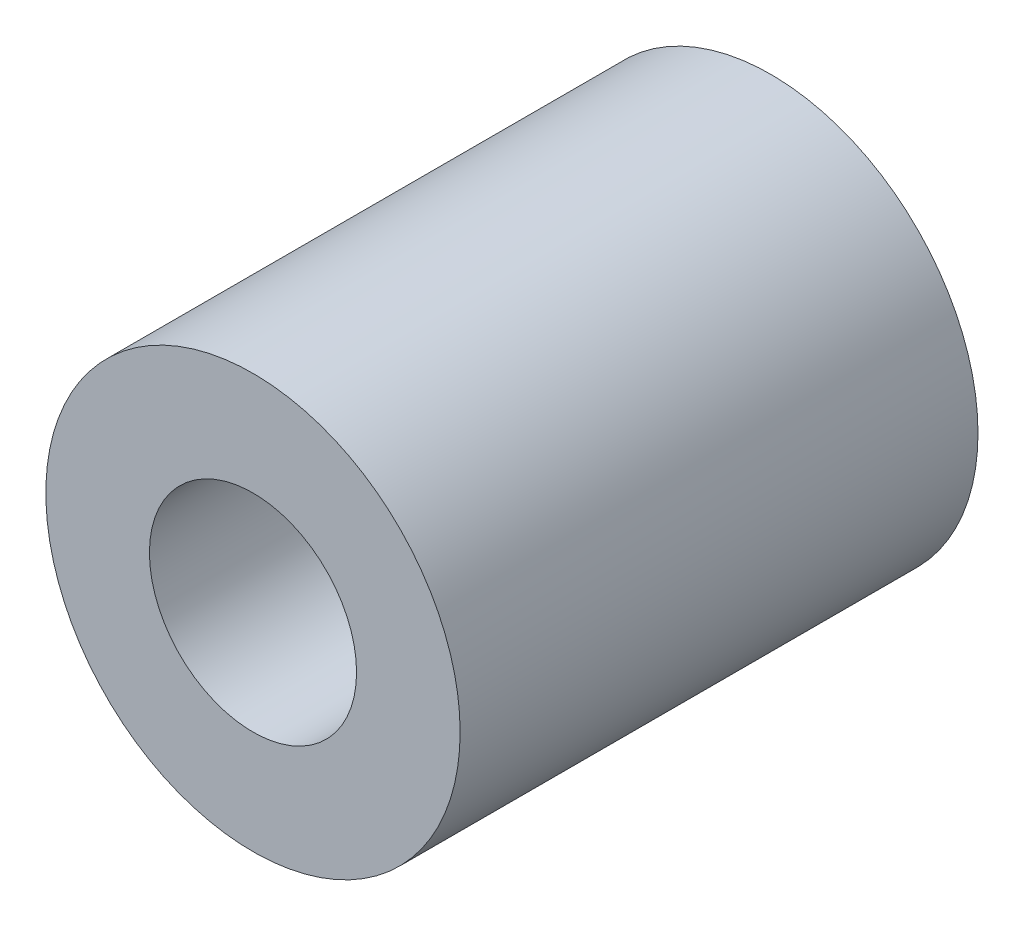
ISO-10303-21;
HEADER;
FILE_DESCRIPTION(('STEP AP214'),'2;1');
FILE_NAME('part.step','',(''),(''),'','','');
FILE_SCHEMA(('AUTOMOTIVE_DESIGN { 1 0 10303 214 1 1 1 1 }'));
ENDSEC;
DATA;
#1=APPLICATION_CONTEXT('core data for automotive mechanical design processes');
#2=APPLICATION_PROTOCOL_DEFINITION('international standard','automotive_design',2000,#1);
#3=PRODUCT_CONTEXT('',#1,'mechanical');
#4=PRODUCT('Part','Part','',(#3));
#5=PRODUCT_RELATED_PRODUCT_CATEGORY('part','',(#4));
#6=PRODUCT_DEFINITION_FORMATION('','',#4);
#7=PRODUCT_DEFINITION_CONTEXT('part definition',#1,'design');
#8=PRODUCT_DEFINITION('design','',#6,#7);
#9=PRODUCT_DEFINITION_SHAPE('','',#8);
#10=(LENGTH_UNIT() NAMED_UNIT(*) SI_UNIT(.MILLI.,.METRE.));
#11=(NAMED_UNIT(*) PLANE_ANGLE_UNIT() SI_UNIT($,.RADIAN.));
#12=(NAMED_UNIT(*) SI_UNIT($,.STERADIAN.) SOLID_ANGLE_UNIT());
#13=UNCERTAINTY_MEASURE_WITH_UNIT(LENGTH_MEASURE(1.E-05),#10,'distance_accuracy_value','');
#14=(GEOMETRIC_REPRESENTATION_CONTEXT(3) GLOBAL_UNCERTAINTY_ASSIGNED_CONTEXT((#13)) GLOBAL_UNIT_ASSIGNED_CONTEXT((#10,
#11,#12)) REPRESENTATION_CONTEXT('',''));
#15=CARTESIAN_POINT('',(0.,0.,0.));
#16=DIRECTION('',(0.,0.,1.));
#17=DIRECTION('',(1.,0.,0.));
#18=AXIS2_PLACEMENT_3D('',#15,#16,#17);
#19=CARTESIAN_POINT('',(0.,0.,40.));
#20=DIRECTION('',(0.,0.,1.));
#21=DIRECTION('',(1.,0.,0.));
#22=AXIS2_PLACEMENT_3D('',#19,#20,#21);
#23=CYLINDRICAL_SURFACE('',#22,6.);
#24=CARTESIAN_POINT('',(0.,0.,0.));
#25=DIRECTION('',(0.,0.,1.));
#26=DIRECTION('',(1.,0.,0.));
#27=AXIS2_PLACEMENT_3D('',#24,#25,#26);
#28=CIRCLE('',#27,6.);
#29=CARTESIAN_POINT('',(6.,0.,0.));
#30=VERTEX_POINT('',#29);
#31=EDGE_CURVE('E8',#30,#30,#28,.T.);
#32=ORIENTED_EDGE('',*,*,#31,.F.);
#33=EDGE_LOOP('',(#32));
#34=FACE_BOUND('',#33,.T.);
#35=CARTESIAN_POINT('',(0.,0.,12.));
#36=DIRECTION('',(0.,0.,1.));
#37=DIRECTION('',(1.,0.,0.));
#38=AXIS2_PLACEMENT_3D('',#35,#36,#37);
#39=CIRCLE('',#38,6.);
#40=CARTESIAN_POINT('',(6.,0.,12.));
#41=VERTEX_POINT('',#40);
#42=EDGE_CURVE('E34',#41,#41,#39,.T.);
#43=ORIENTED_EDGE('',*,*,#42,.T.);
#44=EDGE_LOOP('',(#43));
#45=FACE_BOUND('',#44,.T.);
#46=ADVANCED_FACE('F12',(#34,#45),#23,.F.);
#47=CARTESIAN_POINT('',(6.,0.,0.));
#48=DIRECTION('',(0.,0.,1.));
#49=DIRECTION('',(1.,0.,0.));
#50=AXIS2_PLACEMENT_3D('',#47,#48,#49);
#51=PLANE('',#50);
#52=CARTESIAN_POINT('',(0.,0.,0.));
#53=DIRECTION('',(0.,0.,1.));
#54=DIRECTION('',(1.,0.,0.));
#55=AXIS2_PLACEMENT_3D('',#52,#53,#54);
#56=CIRCLE('',#55,20.);
#57=CARTESIAN_POINT('',(20.,0.,0.));
#58=VERTEX_POINT('',#57);
#59=EDGE_CURVE('E18',#58,#58,#56,.T.);
#60=ORIENTED_EDGE('',*,*,#59,.F.);
#61=EDGE_LOOP('',(#60));
#62=FACE_BOUND('',#61,.T.);
#63=ORIENTED_EDGE('',*,*,#31,.T.);
#64=EDGE_LOOP('',(#63));
#65=FACE_BOUND('',#64,.T.);
#66=ADVANCED_FACE('F59',(#62,#65),#51,.F.);
#67=CARTESIAN_POINT('',(0.,0.,40.));
#68=DIRECTION('',(0.,0.,1.));
#69=DIRECTION('',(1.,0.,0.));
#70=AXIS2_PLACEMENT_3D('',#67,#68,#69);
#71=CYLINDRICAL_SURFACE('',#70,20.);
#72=CARTESIAN_POINT('',(0.,0.,50.));
#73=DIRECTION('',(0.,0.,1.));
#74=DIRECTION('',(1.,0.,0.));
#75=AXIS2_PLACEMENT_3D('',#72,#73,#74);
#76=CIRCLE('',#75,20.);
#77=CARTESIAN_POINT('',(20.,0.,50.));
#78=VERTEX_POINT('',#77);
#79=EDGE_CURVE('E22',#78,#78,#76,.T.);
#80=ORIENTED_EDGE('',*,*,#79,.F.);
#81=EDGE_LOOP('',(#80));
#82=FACE_BOUND('',#81,.T.);
#83=ORIENTED_EDGE('',*,*,#59,.T.);
#84=EDGE_LOOP('',(#83));
#85=FACE_BOUND('',#84,.T.);
#86=ADVANCED_FACE('F54',(#82,#85),#71,.T.);
#87=CARTESIAN_POINT('',(20.,0.,50.));
#88=DIRECTION('',(0.,0.,-1.));
#89=DIRECTION('',(-1.,0.,0.));
#90=AXIS2_PLACEMENT_3D('',#87,#88,#89);
#91=PLANE('',#90);
#92=CARTESIAN_POINT('',(0.,0.,50.));
#93=DIRECTION('',(0.,0.,1.));
#94=DIRECTION('',(1.,0.,0.));
#95=AXIS2_PLACEMENT_3D('',#92,#93,#94);
#96=CIRCLE('',#95,10.);
#97=CARTESIAN_POINT('',(10.,0.,50.));
#98=VERTEX_POINT('',#97);
#99=EDGE_CURVE('E26',#98,#98,#96,.T.);
#100=ORIENTED_EDGE('',*,*,#99,.F.);
#101=EDGE_LOOP('',(#100));
#102=FACE_BOUND('',#101,.T.);
#103=ORIENTED_EDGE('',*,*,#79,.T.);
#104=EDGE_LOOP('',(#103));
#105=FACE_BOUND('',#104,.T.);
#106=ADVANCED_FACE('F48',(#102,#105),#91,.F.);
#107=CARTESIAN_POINT('',(0.,0.,40.));
#108=DIRECTION('',(0.,0.,1.));
#109=DIRECTION('',(1.,0.,0.));
#110=AXIS2_PLACEMENT_3D('',#107,#108,#109);
#111=CYLINDRICAL_SURFACE('',#110,10.);
#112=CARTESIAN_POINT('',(0.,0.,12.));
#113=DIRECTION('',(0.,0.,1.));
#114=DIRECTION('',(1.,0.,0.));
#115=AXIS2_PLACEMENT_3D('',#112,#113,#114);
#116=CIRCLE('',#115,10.);
#117=CARTESIAN_POINT('',(10.,0.,12.));
#118=VERTEX_POINT('',#117);
#119=EDGE_CURVE('E31',#118,#118,#116,.T.);
#120=ORIENTED_EDGE('',*,*,#119,.F.);
#121=EDGE_LOOP('',(#120));
#122=FACE_BOUND('',#121,.T.);
#123=ORIENTED_EDGE('',*,*,#99,.T.);
#124=EDGE_LOOP('',(#123));
#125=FACE_BOUND('',#124,.T.);
#126=ADVANCED_FACE('F42',(#122,#125),#111,.F.);
#127=CARTESIAN_POINT('',(10.,0.,12.));
#128=DIRECTION('',(0.,0.,-1.));
#129=DIRECTION('',(-1.,0.,0.));
#130=AXIS2_PLACEMENT_3D('',#127,#128,#129);
#131=PLANE('',#130);
#132=ORIENTED_EDGE('',*,*,#42,.F.);
#133=EDGE_LOOP('',(#132));
#134=FACE_BOUND('',#133,.T.);
#135=ORIENTED_EDGE('',*,*,#119,.T.);
#136=EDGE_LOOP('',(#135));
#137=FACE_BOUND('',#136,.T.);
#138=ADVANCED_FACE('F39',(#134,#137),#131,.F.);
#139=CLOSED_SHELL('',(#46,#66,#86,#106,#126,#138));
#140=MANIFOLD_SOLID_BREP('B1',#139);
#141=ADVANCED_BREP_SHAPE_REPRESENTATION('',(#18,#140),#14);
#142=SHAPE_DEFINITION_REPRESENTATION(#9,#141);
ENDSEC;
END-ISO-10303-21;
